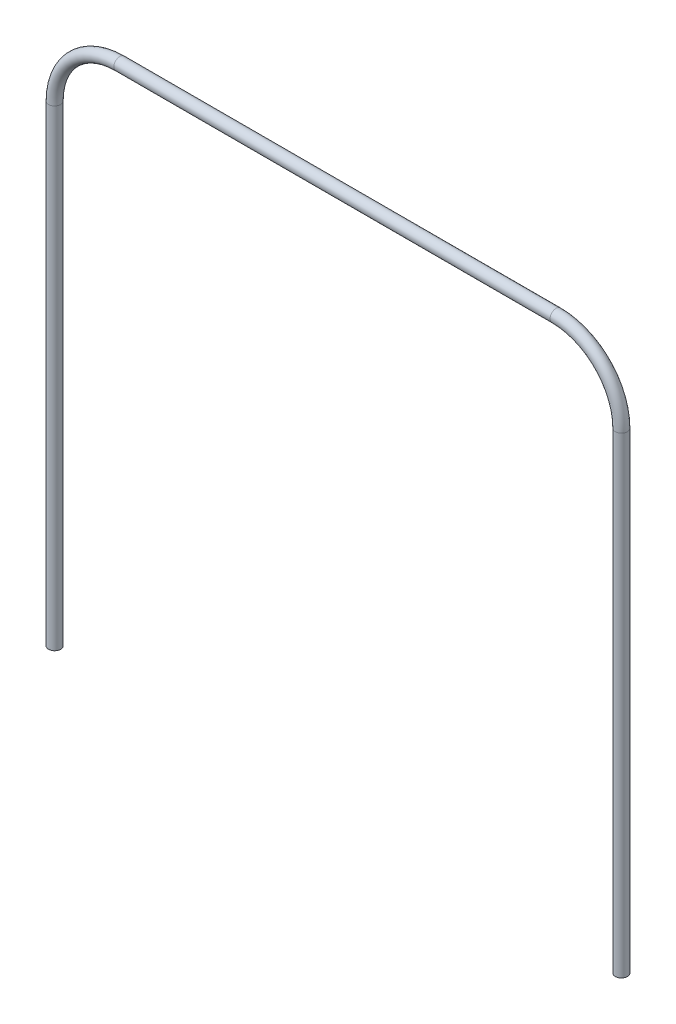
ISO-10303-21;
HEADER;
FILE_DESCRIPTION(('STEP AP214'),'2;1');
FILE_NAME('part.step','',(''),(''),'','','');
FILE_SCHEMA(('AUTOMOTIVE_DESIGN { 1 0 10303 214 1 1 1 1 }'));
ENDSEC;
DATA;
#1=APPLICATION_CONTEXT('core data for automotive mechanical design processes');
#2=APPLICATION_PROTOCOL_DEFINITION('international standard','automotive_design',2000,#1);
#3=PRODUCT_CONTEXT('',#1,'mechanical');
#4=PRODUCT('Part','Part','',(#3));
#5=PRODUCT_RELATED_PRODUCT_CATEGORY('part','',(#4));
#6=PRODUCT_DEFINITION_FORMATION('','',#4);
#7=PRODUCT_DEFINITION_CONTEXT('part definition',#1,'design');
#8=PRODUCT_DEFINITION('design','',#6,#7);
#9=PRODUCT_DEFINITION_SHAPE('','',#8);
#10=(LENGTH_UNIT() NAMED_UNIT(*) SI_UNIT(.MILLI.,.METRE.));
#11=(NAMED_UNIT(*) PLANE_ANGLE_UNIT() SI_UNIT($,.RADIAN.));
#12=(NAMED_UNIT(*) SI_UNIT($,.STERADIAN.) SOLID_ANGLE_UNIT());
#13=UNCERTAINTY_MEASURE_WITH_UNIT(LENGTH_MEASURE(1.E-05),#10,'distance_accuracy_value','');
#14=(GEOMETRIC_REPRESENTATION_CONTEXT(3) GLOBAL_UNCERTAINTY_ASSIGNED_CONTEXT((#13)) GLOBAL_UNIT_ASSIGNED_CONTEXT((#10,
#11,#12)) REPRESENTATION_CONTEXT('',''));
#15=CARTESIAN_POINT('',(0.,0.,0.));
#16=DIRECTION('',(0.,0.,1.));
#17=DIRECTION('',(1.,0.,0.));
#18=AXIS2_PLACEMENT_3D('',#15,#16,#17);
#19=CARTESIAN_POINT('',(564.55,470.,0.));
#20=DIRECTION('',(0.,-1.,0.));
#21=DIRECTION('',(1.,0.,0.));
#22=AXIS2_PLACEMENT_3D('',#19,#20,#21);
#23=CYLINDRICAL_SURFACE('',#22,6.);
#24=CARTESIAN_POINT('',(564.55,470.,0.));
#25=DIRECTION('',(0.,-1.,0.));
#26=DIRECTION('',(0.,0.,1.));
#27=AXIS2_PLACEMENT_3D('',#24,#25,#26);
#28=CIRCLE('',#27,6.);
#29=CARTESIAN_POINT('',(570.55,470.,0.));
#30=VERTEX_POINT('',#29);
#31=EDGE_CURVE('E35',#30,#30,#28,.T.);
#32=CARTESIAN_POINT('',(564.55,0.,0.));
#33=DIRECTION('',(0.,-1.,0.));
#34=DIRECTION('',(0.,0.,1.));
#35=AXIS2_PLACEMENT_3D('',#32,#33,#34);
#36=CIRCLE('',#35,6.);
#37=CARTESIAN_POINT('',(570.55,0.,0.));
#38=VERTEX_POINT('',#37);
#39=EDGE_CURVE('E10',#38,#38,#36,.T.);
#40=CARTESIAN_POINT('',(570.55,470.,0.));
#41=CARTESIAN_POINT('',(570.55,465.104166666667,0.));
#42=CARTESIAN_POINT('',(570.55,460.208333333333,0.));
#43=CARTESIAN_POINT('',(570.55,450.416666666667,0.));
#44=CARTESIAN_POINT('',(570.55,445.520833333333,0.));
#45=CARTESIAN_POINT('',(570.55,435.729166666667,0.));
#46=CARTESIAN_POINT('',(570.55,430.833333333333,0.));
#47=CARTESIAN_POINT('',(570.55,421.041666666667,0.));
#48=CARTESIAN_POINT('',(570.55,416.145833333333,0.));
#49=CARTESIAN_POINT('',(570.55,406.354166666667,0.));
#50=CARTESIAN_POINT('',(570.55,401.458333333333,0.));
#51=CARTESIAN_POINT('',(570.55,391.666666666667,0.));
#52=CARTESIAN_POINT('',(570.55,386.770833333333,0.));
#53=CARTESIAN_POINT('',(570.55,376.979166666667,0.));
#54=CARTESIAN_POINT('',(570.55,372.083333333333,0.));
#55=CARTESIAN_POINT('',(570.55,362.291666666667,0.));
#56=CARTESIAN_POINT('',(570.55,357.395833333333,0.));
#57=CARTESIAN_POINT('',(570.55,347.604166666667,0.));
#58=CARTESIAN_POINT('',(570.55,342.708333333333,0.));
#59=CARTESIAN_POINT('',(570.55,332.916666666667,0.));
#60=CARTESIAN_POINT('',(570.55,328.020833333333,0.));
#61=CARTESIAN_POINT('',(570.55,318.229166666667,0.));
#62=CARTESIAN_POINT('',(570.55,313.333333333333,0.));
#63=CARTESIAN_POINT('',(570.55,303.541666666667,0.));
#64=CARTESIAN_POINT('',(570.55,298.645833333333,0.));
#65=CARTESIAN_POINT('',(570.55,288.854166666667,0.));
#66=CARTESIAN_POINT('',(570.55,283.958333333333,0.));
#67=CARTESIAN_POINT('',(570.55,274.166666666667,0.));
#68=CARTESIAN_POINT('',(570.55,269.270833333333,0.));
#69=CARTESIAN_POINT('',(570.55,259.479166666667,0.));
#70=CARTESIAN_POINT('',(570.55,254.583333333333,0.));
#71=CARTESIAN_POINT('',(570.55,244.791666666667,0.));
#72=CARTESIAN_POINT('',(570.55,239.895833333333,0.));
#73=CARTESIAN_POINT('',(570.55,230.104166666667,0.));
#74=CARTESIAN_POINT('',(570.55,225.208333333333,0.));
#75=CARTESIAN_POINT('',(570.55,215.416666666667,0.));
#76=CARTESIAN_POINT('',(570.55,210.520833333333,0.));
#77=CARTESIAN_POINT('',(570.55,200.729166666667,0.));
#78=CARTESIAN_POINT('',(570.55,195.833333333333,0.));
#79=CARTESIAN_POINT('',(570.55,186.041666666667,0.));
#80=CARTESIAN_POINT('',(570.55,181.145833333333,0.));
#81=CARTESIAN_POINT('',(570.55,171.354166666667,0.));
#82=CARTESIAN_POINT('',(570.55,166.458333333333,0.));
#83=CARTESIAN_POINT('',(570.55,156.666666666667,0.));
#84=CARTESIAN_POINT('',(570.55,151.770833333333,0.));
#85=CARTESIAN_POINT('',(570.55,141.979166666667,0.));
#86=CARTESIAN_POINT('',(570.55,137.083333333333,0.));
#87=CARTESIAN_POINT('',(570.55,127.291666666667,0.));
#88=CARTESIAN_POINT('',(570.55,122.395833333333,0.));
#89=CARTESIAN_POINT('',(570.55,112.604166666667,0.));
#90=CARTESIAN_POINT('',(570.55,107.708333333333,0.));
#91=CARTESIAN_POINT('',(570.55,97.9166666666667,0.));
#92=CARTESIAN_POINT('',(570.55,93.0208333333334,0.));
#93=CARTESIAN_POINT('',(570.55,83.2291666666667,0.));
#94=CARTESIAN_POINT('',(570.55,78.3333333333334,0.));
#95=CARTESIAN_POINT('',(570.55,68.5416666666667,0.));
#96=CARTESIAN_POINT('',(570.55,63.6458333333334,0.));
#97=CARTESIAN_POINT('',(570.55,53.8541666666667,0.));
#98=CARTESIAN_POINT('',(570.55,48.9583333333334,0.));
#99=CARTESIAN_POINT('',(570.55,39.1666666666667,0.));
#100=CARTESIAN_POINT('',(570.55,34.2708333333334,0.));
#101=CARTESIAN_POINT('',(570.55,24.4791666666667,0.));
#102=CARTESIAN_POINT('',(570.55,19.5833333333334,0.));
#103=CARTESIAN_POINT('',(570.55,9.79166666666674,0.));
#104=CARTESIAN_POINT('',(570.55,4.89583333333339,0.));
#105=CARTESIAN_POINT('',(570.55,0.,0.));
#106=B_SPLINE_CURVE_WITH_KNOTS('',3,(#40,#41,#42,#43,#44,#45,#46,#47,#48,#49,#50,#51,#52,#53,
#54,#55,#56,#57,#58,#59,#60,#61,#62,#63,#64,#65,#66,#67,#68,#69,#70,#71,#72,#73,#74,#75,#76,#77,
#78,#79,#80,#81,#82,#83,#84,#85,#86,#87,#88,#89,#90,#91,#92,#93,#94,#95,#96,#97,#98,#99,#100,
#101,#102,#103,#104,#105),.UNSPECIFIED.,.F.,.F.,(4,2,2,2,2,2,2,2,2,2,2,2,2,2,2,2,2,2,2,2,2,2,2,
2,2,2,2,2,2,2,2,2,4),(0.,14.6875,29.375,44.0625,58.75,73.4374999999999,88.125,102.8125,117.5,
132.1875,146.875,161.5625,176.25,190.9375,205.625,220.3125,235.,249.6875,264.375,279.0625,
293.75,308.4375,323.125,337.8125,352.5,367.1875,381.875,396.5625,411.25,425.9375,440.625,
455.3125,470.),.UNSPECIFIED.);
#107=EDGE_CURVE('BSEAM29',#30,#38,#106,.T.);
#108=ORIENTED_EDGE('',*,*,#31,.T.);
#109=ORIENTED_EDGE('',*,*,#39,.F.);
#110=ORIENTED_EDGE('',*,*,#107,.T.);
#111=ORIENTED_EDGE('',*,*,#107,.F.);
#112=EDGE_LOOP('',(#108,#110,#109,#111));
#113=FACE_BOUND('',#112,.T.);
#114=ADVANCED_FACE('F29',(#113),#23,.T.);
#115=CARTESIAN_POINT('',(499.55,470.,0.));
#116=DIRECTION('',(0.,0.,-1.));
#117=DIRECTION('',(-1.,0.,0.));
#118=AXIS2_PLACEMENT_3D('',#115,#116,#117);
#119=TOROIDAL_SURFACE('',#118,65.,6.);
#120=CARTESIAN_POINT('',(499.55,535.,0.));
#121=DIRECTION('',(1.,0.,0.));
#122=DIRECTION('',(0.,0.,1.));
#123=AXIS2_PLACEMENT_3D('',#120,#121,#122);
#124=CIRCLE('',#123,6.);
#125=CARTESIAN_POINT('',(499.55,541.,0.));
#126=VERTEX_POINT('',#125);
#127=EDGE_CURVE('E39',#126,#126,#124,.T.);
#128=CARTESIAN_POINT('',(499.55,470.,0.));
#129=DIRECTION('',(0.,0.,-1.));
#130=DIRECTION('',(-1.,0.,0.));
#131=AXIS2_PLACEMENT_3D('',#128,#129,#130);
#132=CIRCLE('',#131,71.);
#133=EDGE_CURVE('',#126,#30,#132,.T.);
#134=ORIENTED_EDGE('',*,*,#127,.T.);
#135=ORIENTED_EDGE('',*,*,#31,.F.);
#136=ORIENTED_EDGE('',*,*,#133,.T.);
#137=ORIENTED_EDGE('',*,*,#133,.F.);
#138=EDGE_LOOP('',(#134,#136,#135,#137));
#139=FACE_BOUND('',#138,.T.);
#140=ADVANCED_FACE('F66',(#139),#119,.T.);
#141=CARTESIAN_POINT('',(65.,535.,0.));
#142=DIRECTION('',(1.,0.,0.));
#143=DIRECTION('',(0.,0.,-1.));
#144=AXIS2_PLACEMENT_3D('',#141,#142,#143);
#145=CYLINDRICAL_SURFACE('',#144,6.);
#146=CARTESIAN_POINT('',(65.,535.,0.));
#147=DIRECTION('',(1.,0.,0.));
#148=DIRECTION('',(0.,0.,1.));
#149=AXIS2_PLACEMENT_3D('',#146,#147,#148);
#150=CIRCLE('',#149,6.);
#151=CARTESIAN_POINT('',(65.,541.,0.));
#152=VERTEX_POINT('',#151);
#153=EDGE_CURVE('E43',#152,#152,#150,.T.);
#154=ORIENTED_EDGE('',*,*,#153,.T.);
#155=EDGE_LOOP('',(#154));
#156=FACE_BOUND('',#155,.T.);
#157=ORIENTED_EDGE('',*,*,#127,.F.);
#158=EDGE_LOOP('',(#157));
#159=FACE_BOUND('',#158,.T.);
#160=ADVANCED_FACE('F70',(#156,#159),#145,.T.);
#161=CARTESIAN_POINT('',(65.,470.,0.));
#162=DIRECTION('',(0.,0.,-1.));
#163=DIRECTION('',(-1.,0.,0.));
#164=AXIS2_PLACEMENT_3D('',#161,#162,#163);
#165=TOROIDAL_SURFACE('',#164,65.,6.);
#166=CARTESIAN_POINT('',(0.,470.,0.));
#167=DIRECTION('',(0.,1.,0.));
#168=DIRECTION('',(0.,0.,1.));
#169=AXIS2_PLACEMENT_3D('',#166,#167,#168);
#170=CIRCLE('',#169,6.);
#171=CARTESIAN_POINT('',(-6.00000000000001,470.,0.));
#172=VERTEX_POINT('',#171);
#173=EDGE_CURVE('E48',#172,#172,#170,.T.);
#174=CARTESIAN_POINT('',(65.,470.,0.));
#175=DIRECTION('',(0.,0.,-1.));
#176=DIRECTION('',(-1.,0.,0.));
#177=AXIS2_PLACEMENT_3D('',#174,#175,#176);
#178=CIRCLE('',#177,71.);
#179=EDGE_CURVE('',#172,#152,#178,.T.);
#180=ORIENTED_EDGE('',*,*,#173,.T.);
#181=ORIENTED_EDGE('',*,*,#153,.F.);
#182=ORIENTED_EDGE('',*,*,#179,.T.);
#183=ORIENTED_EDGE('',*,*,#179,.F.);
#184=EDGE_LOOP('',(#180,#182,#181,#183));
#185=FACE_BOUND('',#184,.T.);
#186=ADVANCED_FACE('F76',(#185),#165,.T.);
#187=CARTESIAN_POINT('',(0.,470.,0.));
#188=DIRECTION('',(0.,-1.,0.));
#189=DIRECTION('',(0.,0.,-1.));
#190=AXIS2_PLACEMENT_3D('',#187,#188,#189);
#191=CYLINDRICAL_SURFACE('',#190,6.);
#192=ORIENTED_EDGE('',*,*,#173,.F.);
#193=EDGE_LOOP('',(#192));
#194=FACE_BOUND('',#193,.T.);
#195=CARTESIAN_POINT('',(0.,0.,0.));
#196=DIRECTION('',(0.,1.,0.));
#197=DIRECTION('',(0.,0.,1.));
#198=AXIS2_PLACEMENT_3D('',#195,#196,#197);
#199=CIRCLE('',#198,6.);
#200=CARTESIAN_POINT('',(0.,0.,6.));
#201=VERTEX_POINT('',#200);
#202=EDGE_CURVE('E51',#201,#201,#199,.T.);
#203=ORIENTED_EDGE('',*,*,#202,.T.);
#204=EDGE_LOOP('',(#203));
#205=FACE_BOUND('',#204,.T.);
#206=ADVANCED_FACE('F55',(#194,#205),#191,.T.);
#207=CARTESIAN_POINT('',(564.55,0.,0.));
#208=DIRECTION('',(0.,-1.,0.));
#209=DIRECTION('',(0.,0.,1.));
#210=AXIS2_PLACEMENT_3D('',#207,#208,#209);
#211=PLANE('',#210);
#212=ORIENTED_EDGE('',*,*,#39,.T.);
#213=EDGE_LOOP('',(#212));
#214=FACE_BOUND('',#213,.T.);
#215=ADVANCED_FACE('F59',(#214),#211,.T.);
#216=CARTESIAN_POINT('',(0.,0.,0.));
#217=DIRECTION('',(0.,1.,0.));
#218=DIRECTION('',(0.,0.,1.));
#219=AXIS2_PLACEMENT_3D('',#216,#217,#218);
#220=PLANE('',#219);
#221=ORIENTED_EDGE('',*,*,#202,.F.);
#222=EDGE_LOOP('',(#221));
#223=FACE_BOUND('',#222,.T.);
#224=ADVANCED_FACE('F57',(#223),#220,.F.);
#225=CLOSED_SHELL('',(#114,#140,#160,#186,#206,#215,#224));
#226=MANIFOLD_SOLID_BREP('B2',#225);
#227=ADVANCED_BREP_SHAPE_REPRESENTATION('',(#18,#226),#14);
#228=SHAPE_DEFINITION_REPRESENTATION(#9,#227);
ENDSEC;
END-ISO-10303-21;
